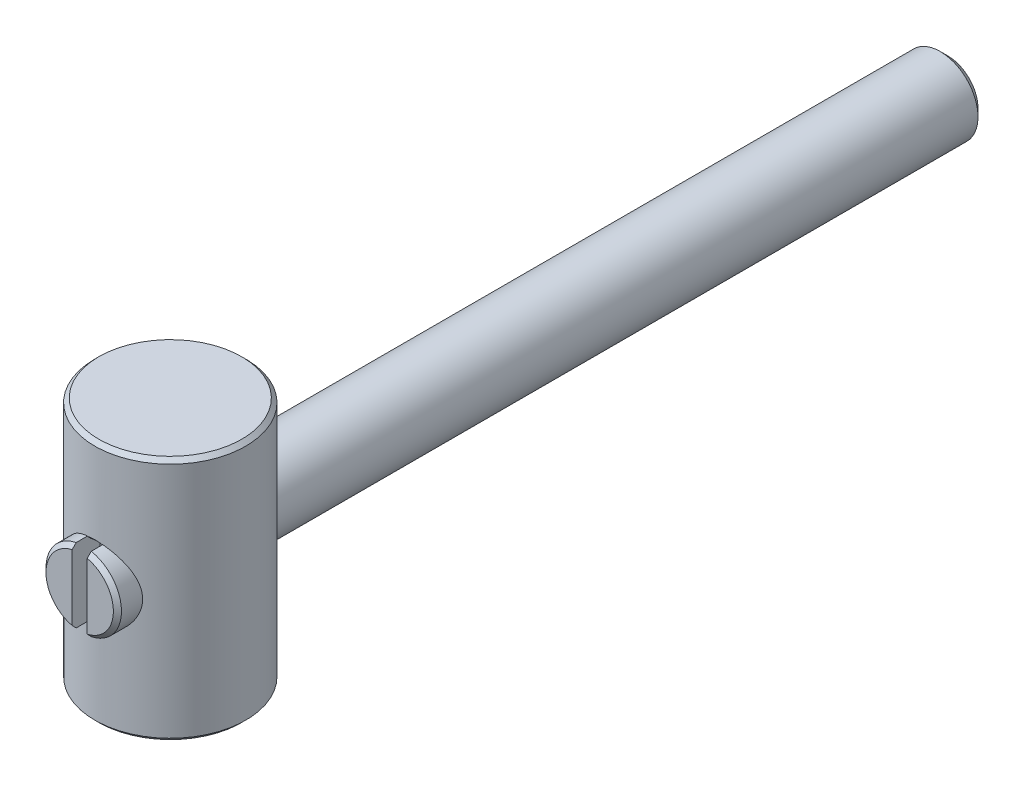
ISO-10303-21;
HEADER;
FILE_DESCRIPTION(('STEP AP214'),'2;1');
FILE_NAME('part.step','',(''),(''),'','','');
FILE_SCHEMA(('AUTOMOTIVE_DESIGN { 1 0 10303 214 1 1 1 1 }'));
ENDSEC;
DATA;
#1=APPLICATION_CONTEXT('core data for automotive mechanical design processes');
#2=APPLICATION_PROTOCOL_DEFINITION('international standard','automotive_design',2000,#1);
#3=PRODUCT_CONTEXT('',#1,'mechanical');
#4=PRODUCT('Part','Part','',(#3));
#5=PRODUCT_RELATED_PRODUCT_CATEGORY('part','',(#4));
#6=PRODUCT_DEFINITION_FORMATION('','',#4);
#7=PRODUCT_DEFINITION_CONTEXT('part definition',#1,'design');
#8=PRODUCT_DEFINITION('design','',#6,#7);
#9=PRODUCT_DEFINITION_SHAPE('','',#8);
#10=(LENGTH_UNIT() NAMED_UNIT(*) SI_UNIT(.MILLI.,.METRE.));
#11=(NAMED_UNIT(*) PLANE_ANGLE_UNIT() SI_UNIT($,.RADIAN.));
#12=(NAMED_UNIT(*) SI_UNIT($,.STERADIAN.) SOLID_ANGLE_UNIT());
#13=UNCERTAINTY_MEASURE_WITH_UNIT(LENGTH_MEASURE(1.E-05),#10,'distance_accuracy_value','');
#14=(GEOMETRIC_REPRESENTATION_CONTEXT(3) GLOBAL_UNCERTAINTY_ASSIGNED_CONTEXT((#13)) GLOBAL_UNIT_ASSIGNED_CONTEXT((#10,
#11,#12)) REPRESENTATION_CONTEXT('',''));
#15=CARTESIAN_POINT('',(0.,0.,0.));
#16=DIRECTION('',(0.,0.,1.));
#17=DIRECTION('',(1.,0.,0.));
#18=AXIS2_PLACEMENT_3D('',#15,#16,#17);
#19=CARTESIAN_POINT('',(0.,0.,4.8));
#20=DIRECTION('',(0.,0.,-1.));
#21=DIRECTION('',(-1.,0.,0.));
#22=AXIS2_PLACEMENT_3D('',#19,#20,#21);
#23=PLANE('',#22);
#24=DIRECTION('',(0.,-1.,0.));
#25=VECTOR('',#24,1.);
#26=CARTESIAN_POINT('',(-0.4,0.,4.8));
#27=LINE('',#26,#25);
#28=CARTESIAN_POINT('',(-0.4,1.74011788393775,4.8));
#29=VERTEX_POINT('',#28);
#30=CARTESIAN_POINT('',(-0.4,-1.74011788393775,4.8));
#31=VERTEX_POINT('',#30);
#32=EDGE_CURVE('E123',#29,#31,#27,.T.);
#33=ORIENTED_EDGE('',*,*,#32,.F.);
#34=CARTESIAN_POINT('',(0.,0.,4.8));
#35=DIRECTION('',(0.,0.,-1.));
#36=DIRECTION('',(-1.,0.,0.));
#37=AXIS2_PLACEMENT_3D('',#34,#35,#36);
#38=CIRCLE('',#37,1.7855);
#39=EDGE_CURVE('E122',#31,#29,#38,.T.);
#40=ORIENTED_EDGE('',*,*,#39,.F.);
#41=EDGE_LOOP('',(#33,#40));
#42=FACE_BOUND('',#41,.T.);
#43=ADVANCED_FACE('F14',(#42),#23,.F.);
#44=CARTESIAN_POINT('',(0.,0.,4.8));
#45=DIRECTION('',(0.,0.,-1.));
#46=DIRECTION('',(-1.,0.,0.));
#47=AXIS2_PLACEMENT_3D('',#44,#45,#46);
#48=CONICAL_SURFACE('',#47,1.7855,0.785398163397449);
#49=CARTESIAN_POINT('',(-0.4,4.38544390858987,2.18185170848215));
#50=CARTESIAN_POINT('',(-0.4,4.22814452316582,2.33849490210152));
#51=CARTESIAN_POINT('',(-0.4,4.07081593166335,2.49510881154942));
#52=CARTESIAN_POINT('',(-0.4,3.75604765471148,2.80824900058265));
#53=CARTESIAN_POINT('',(-0.4,3.59860796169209,2.96477527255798));
#54=CARTESIAN_POINT('',(-0.4,3.28330186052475,3.27797222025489));
#55=CARTESIAN_POINT('',(-0.4,3.12543519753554,3.43464263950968));
#56=CARTESIAN_POINT('',(-0.4,2.80949525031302,3.74775156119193));
#57=CARTESIAN_POINT('',(-0.4,2.65142198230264,3.90419007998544));
#58=CARTESIAN_POINT('',(-0.4,2.34523716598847,4.20651333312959));
#59=CARTESIAN_POINT('',(-0.4,2.19714827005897,4.35242098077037));
#60=CARTESIAN_POINT('',(-0.4,1.9745743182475,4.57086698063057));
#61=CARTESIAN_POINT('',(-0.4,1.90030121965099,4.64362119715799));
#62=CARTESIAN_POINT('',(-0.4,1.75155548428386,4.78892225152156));
#63=CARTESIAN_POINT('',(-0.4,1.67708285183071,4.86146909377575));
#64=CARTESIAN_POINT('',(-0.4,1.52792681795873,5.0061860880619));
#65=CARTESIAN_POINT('',(-0.4,1.45324372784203,5.07835656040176));
#66=CARTESIAN_POINT('',(-0.4,1.303425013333,5.22223884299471));
#67=CARTESIAN_POINT('',(-0.4,1.22828935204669,5.29395061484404));
#68=CARTESIAN_POINT('',(-0.4,1.07732483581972,5.436586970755));
#69=CARTESIAN_POINT('',(-0.4,1.00149626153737,5.50751184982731));
#70=CARTESIAN_POINT('',(-0.4,0.886762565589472,5.61281093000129));
#71=CARTESIAN_POINT('',(-0.4,0.848355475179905,5.64772694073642));
#72=CARTESIAN_POINT('',(-0.4,0.771065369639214,5.71702726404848));
#73=CARTESIAN_POINT('',(-0.4,0.732182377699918,5.75141160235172));
#74=CARTESIAN_POINT('',(-0.4,0.670990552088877,5.80440505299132));
#75=CARTESIAN_POINT('',(-0.4,0.648923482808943,5.82329300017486));
#76=CARTESIAN_POINT('',(-0.4,0.604504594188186,5.86073627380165));
#77=CARTESIAN_POINT('',(-0.4,0.582152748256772,5.87929156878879));
#78=CARTESIAN_POINT('',(-0.4,0.536811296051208,5.91617925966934));
#79=CARTESIAN_POINT('',(-0.4,0.513817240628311,5.9345062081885));
#80=CARTESIAN_POINT('',(-0.4,0.467342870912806,5.97052571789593));
#81=CARTESIAN_POINT('',(-0.4,0.443862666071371,5.98821841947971));
#82=CARTESIAN_POINT('',(-0.4,0.395899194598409,6.02295404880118));
#83=CARTESIAN_POINT('',(-0.4,0.371406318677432,6.0399838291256));
#84=CARTESIAN_POINT('',(-0.4,0.321466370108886,6.07268136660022));
#85=CARTESIAN_POINT('',(-0.4,0.296018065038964,6.08834727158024));
#86=CARTESIAN_POINT('',(-0.4,0.244218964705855,6.11732584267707));
#87=CARTESIAN_POINT('',(-0.4,0.217884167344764,6.13066640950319));
#88=CARTESIAN_POINT('',(-0.4,0.1637878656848,6.15395132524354));
#89=CARTESIAN_POINT('',(-0.4,0.136031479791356,6.16390699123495));
#90=CARTESIAN_POINT('',(-0.4,0.0811637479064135,6.17813666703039));
#91=CARTESIAN_POINT('',(-0.4,0.0541522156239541,6.18277112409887));
#92=CARTESIAN_POINT('',(-0.4,-0.000201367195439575,6.18641177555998));
#93=CARTESIAN_POINT('',(-0.4,-0.0275422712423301,6.18543380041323));
#94=CARTESIAN_POINT('',(-0.4,-0.08124913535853,6.17820280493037));
#95=CARTESIAN_POINT('',(-0.4,-0.107621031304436,6.17199093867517));
#96=CARTESIAN_POINT('',(-0.4,-0.146271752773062,6.15977299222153));
#97=CARTESIAN_POINT('',(-0.4,-0.159041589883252,6.1551986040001));
#98=CARTESIAN_POINT('',(-0.4,-0.184264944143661,6.14525020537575));
#99=CARTESIAN_POINT('',(-0.4,-0.196718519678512,6.13987634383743));
#100=CARTESIAN_POINT('',(-0.4,-0.23353200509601,6.12283069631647));
#101=CARTESIAN_POINT('',(-0.4,-0.257445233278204,6.1102004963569));
#102=CARTESIAN_POINT('',(-0.4,-0.304317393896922,6.08326318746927));
#103=CARTESIAN_POINT('',(-0.4,-0.327275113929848,6.06895403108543));
#104=CARTESIAN_POINT('',(-0.4,-0.37252645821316,6.03916204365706));
#105=CARTESIAN_POINT('',(-0.4,-0.39481743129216,6.0236752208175));
#106=CARTESIAN_POINT('',(-0.4,-0.438833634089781,5.99191398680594));
#107=CARTESIAN_POINT('',(-0.4,-0.460558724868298,5.97563938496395));
#108=CARTESIAN_POINT('',(-0.4,-0.525520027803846,5.92565754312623));
#109=CARTESIAN_POINT('',(-0.4,-0.568098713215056,5.89109840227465));
#110=CARTESIAN_POINT('',(-0.4,-0.631123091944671,5.83837882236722));
#111=CARTESIAN_POINT('',(-0.4,-0.651965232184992,5.82068135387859));
#112=CARTESIAN_POINT('',(-0.4,-0.693435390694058,5.7850382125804));
#113=CARTESIAN_POINT('',(-0.4,-0.714063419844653,5.76709255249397));
#114=CARTESIAN_POINT('',(-0.4,-0.774606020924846,5.71392260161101));
#115=CARTESIAN_POINT('',(-0.4,-0.814284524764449,5.67843014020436));
#116=CARTESIAN_POINT('',(-0.4,-0.893204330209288,5.60696168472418));
#117=CARTESIAN_POINT('',(-0.4,-0.932445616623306,5.57098567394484));
#118=CARTESIAN_POINT('',(-0.4,-1.04971807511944,5.46255349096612));
#119=CARTESIAN_POINT('',(-0.4,-1.12728939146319,5.38960072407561));
#120=CARTESIAN_POINT('',(-0.4,-1.28178514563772,5.24296666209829));
#121=CARTESIAN_POINT('',(-0.4,-1.35870936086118,5.16928513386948));
#122=CARTESIAN_POINT('',(-0.4,-1.51213277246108,5.0214909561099));
#123=CARTESIAN_POINT('',(-0.4,-1.58863199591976,4.94737833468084));
#124=CARTESIAN_POINT('',(-0.4,-1.81796193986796,4.72440140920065));
#125=CARTESIAN_POINT('',(-0.4,-1.97038982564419,4.57512336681));
#126=CARTESIAN_POINT('',(-0.4,-2.27470082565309,4.27606244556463));
#127=CARTESIAN_POINT('',(-0.4,-2.4265840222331,4.12627965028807));
#128=CARTESIAN_POINT('',(-0.4,-2.65349094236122,3.90205377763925));
#129=CARTESIAN_POINT('',(-0.4,-2.72863003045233,3.82772743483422));
#130=CARTESIAN_POINT('',(-0.4,-2.87885103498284,3.67901233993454));
#131=CARTESIAN_POINT('',(-0.4,-2.95393294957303,3.60462358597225));
#132=CARTESIAN_POINT('',(-0.4,-3.17903278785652,3.3814616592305));
#133=CARTESIAN_POINT('',(-0.4,-3.32898065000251,3.23261781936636));
#134=CARTESIAN_POINT('',(-0.4,-3.63002720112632,2.93354169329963));
#135=CARTESIAN_POINT('',(-0.4,-3.78112484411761,2.78330835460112));
#136=CARTESIAN_POINT('',(-0.4,-4.0833055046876,2.48267648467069));
#137=CARTESIAN_POINT('',(-0.4,-4.2343884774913,2.3322779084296));
#138=CARTESIAN_POINT('',(-0.4,-4.38544390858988,2.18185170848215));
#139=B_SPLINE_CURVE_WITH_KNOTS('',3,(#49,#50,#51,#52,#53,#54,#55,#56,#57,#58,#59,#60,#61,#62,
#63,#64,#65,#66,#67,#68,#69,#70,#71,#72,#73,#74,#75,#76,#77,#78,#79,#80,#81,#82,#83,#84,#85,#86,
#87,#88,#89,#90,#91,#92,#93,#94,#95,#96,#97,#98,#99,#100,#101,#102,#103,#104,#105,#106,#107,
#108,#109,#110,#111,#112,#113,#114,#115,#116,#117,#118,#119,#120,#121,#122,#123,#124,#125,#126,
#127,#128,#129,#130,#131,#132,#133,#134,#135,#136,#137,#138),.UNSPECIFIED.,.F.,.F.,(4,2,2,2,2,2,
2,2,2,2,2,2,2,2,2,2,2,2,2,2,2,2,2,2,2,2,2,2,2,2,2,2,2,2,2,2,2,2,2,2,2,2,2,2,4),(0.,
0.665974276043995,1.33199943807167,1.99923802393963,2.6664270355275,3.29010400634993,
3.60201239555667,3.91391408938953,4.22548161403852,4.53707489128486,4.84854710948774,
5.00426229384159,5.15996991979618,5.24710757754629,5.33425343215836,5.42245810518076,
5.51064313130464,5.60010728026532,5.68969108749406,5.77811232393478,5.86623495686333,
5.9479508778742,6.0294364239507,6.1102871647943,6.15096076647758,6.19162680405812,
6.27264196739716,6.35375697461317,6.43516036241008,6.5165835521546,6.68104442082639,
6.76307124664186,6.84509388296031,7.00479619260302,7.16450403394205,7.48395372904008,
7.80350915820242,8.12304398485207,8.76309054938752,9.40303588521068,9.72010458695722,
10.037183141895,10.6710202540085,11.3102423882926,11.9497829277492),.UNSPECIFIED.);
#140=CARTESIAN_POINT('',(-0.4,1.95959179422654,4.5855));
#141=VERTEX_POINT('',#140);
#142=EDGE_CURVE('E104',#141,#29,#139,.T.);
#143=ORIENTED_EDGE('',*,*,#142,.F.);
#144=CARTESIAN_POINT('',(0.,0.,4.5855));
#145=DIRECTION('',(0.,0.,-1.));
#146=DIRECTION('',(-1.,0.,0.));
#147=AXIS2_PLACEMENT_3D('',#144,#145,#146);
#148=CIRCLE('',#147,2.);
#149=CARTESIAN_POINT('',(-0.4,-1.95959179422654,4.5855));
#150=VERTEX_POINT('',#149);
#151=EDGE_CURVE('E120',#150,#141,#148,.T.);
#152=ORIENTED_EDGE('',*,*,#151,.F.);
#153=EDGE_CURVE('E126',#31,#150,#139,.T.);
#154=ORIENTED_EDGE('',*,*,#153,.F.);
#155=ORIENTED_EDGE('',*,*,#39,.T.);
#156=EDGE_LOOP('',(#143,#152,#154,#155));
#157=FACE_BOUND('',#156,.T.);
#158=ADVANCED_FACE('F118',(#157),#48,.T.);
#159=CARTESIAN_POINT('',(0.4,0.,34.8));
#160=DIRECTION('',(-1.,0.,0.));
#161=DIRECTION('',(0.,-1.,0.));
#162=AXIS2_PLACEMENT_3D('',#159,#160,#161);
#163=CYLINDRICAL_SURFACE('',#162,31.5);
#164=CARTESIAN_POINT('',(0.4,-1.76576053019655,3.34952957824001));
#165=CARTESIAN_POINT('',(0.349977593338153,-1.77709824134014,3.35016706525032));
#166=CARTESIAN_POINT('',(0.299469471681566,-1.78629930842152,3.35068890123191));
#167=CARTESIAN_POINT('',(0.197847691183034,-1.80038671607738,3.35149171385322));
#168=CARTESIAN_POINT('',(0.146733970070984,-1.8052726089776,3.35177266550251));
#169=CARTESIAN_POINT('',(0.0452193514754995,-1.81063609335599,3.35208115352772));
#170=CARTESIAN_POINT('',(-0.00517737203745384,-1.81119308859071,3.35211325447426));
#171=CARTESIAN_POINT('',(-0.105833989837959,-1.80810483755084,3.3519355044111));
#172=CARTESIAN_POINT('',(-0.156093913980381,-1.8044605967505,3.35172571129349));
#173=CARTESIAN_POINT('',(-0.238696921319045,-1.79499603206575,3.3511843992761));
#174=CARTESIAN_POINT('',(-0.271182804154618,-1.7903758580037,3.35092073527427));
#175=CARTESIAN_POINT('',(-0.335843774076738,-1.77938039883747,3.35029676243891));
#176=CARTESIAN_POINT('',(-0.368018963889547,-1.77300571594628,3.34993648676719));
#177=CARTESIAN_POINT('',(-0.4,-1.76576053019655,3.34952957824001));
#178=B_SPLINE_CURVE_WITH_KNOTS('',3,(#164,#165,#166,#167,#168,#169,#170,#171,#172,#173,#174,
#175,#176,#177),.UNSPECIFIED.,.F.,.F.,(4,2,2,2,2,2,4),(0.,0.153839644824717,0.307695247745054,
0.458721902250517,0.609712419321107,0.708108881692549,0.806471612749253),.UNSPECIFIED.);
#179=CARTESIAN_POINT('',(0.4,-1.76576053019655,3.34952957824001));
#180=VERTEX_POINT('',#179);
#181=CARTESIAN_POINT('',(-0.4,-1.76576053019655,3.34952957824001));
#182=VERTEX_POINT('',#181);
#183=EDGE_CURVE('E250',#180,#182,#178,.T.);
#184=ORIENTED_EDGE('',*,*,#183,.F.);
#185=CARTESIAN_POINT('',(0.4,0.,34.8));
#186=DIRECTION('',(1.,0.,0.));
#187=DIRECTION('',(0.,1.,0.));
#188=AXIS2_PLACEMENT_3D('',#185,#186,#187);
#189=CIRCLE('',#188,31.5);
#190=CARTESIAN_POINT('',(0.4,1.76576053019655,3.34952957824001));
#191=VERTEX_POINT('',#190);
#192=EDGE_CURVE('E124',#180,#191,#189,.T.);
#193=ORIENTED_EDGE('',*,*,#192,.T.);
#194=CARTESIAN_POINT('',(-0.4,1.76576053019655,3.34952957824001));
#195=CARTESIAN_POINT('',(-0.349977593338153,1.77709824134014,3.35016706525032));
#196=CARTESIAN_POINT('',(-0.299469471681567,1.78629930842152,3.35068890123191));
#197=CARTESIAN_POINT('',(-0.197847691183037,1.80038671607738,3.35149171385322));
#198=CARTESIAN_POINT('',(-0.146733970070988,1.8052726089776,3.35177266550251));
#199=CARTESIAN_POINT('',(-0.0452193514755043,1.81063609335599,3.35208115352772));
#200=CARTESIAN_POINT('',(0.00517737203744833,1.81119308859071,3.35211325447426));
#201=CARTESIAN_POINT('',(0.105833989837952,1.80810483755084,3.3519355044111));
#202=CARTESIAN_POINT('',(0.156093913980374,1.8044605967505,3.35172571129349));
#203=CARTESIAN_POINT('',(0.238696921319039,1.79499603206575,3.3511843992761));
#204=CARTESIAN_POINT('',(0.271182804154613,1.7903758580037,3.35092073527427));
#205=CARTESIAN_POINT('',(0.335843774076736,1.77938039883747,3.35029676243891));
#206=CARTESIAN_POINT('',(0.368018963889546,1.77300571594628,3.34993648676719));
#207=CARTESIAN_POINT('',(0.4,1.76576053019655,3.34952957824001));
#208=B_SPLINE_CURVE_WITH_KNOTS('',3,(#194,#195,#196,#197,#198,#199,#200,#201,#202,#203,#204,
#205,#206,#207),.UNSPECIFIED.,.F.,.F.,(4,2,2,2,2,2,4),(0.,0.153839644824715,0.307695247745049,
0.45872190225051,0.609712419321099,0.708108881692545,0.806471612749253),.UNSPECIFIED.);
#209=CARTESIAN_POINT('',(-0.4,1.76576053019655,3.34952957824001));
#210=VERTEX_POINT('',#209);
#211=EDGE_CURVE('E248',#210,#191,#208,.T.);
#212=ORIENTED_EDGE('',*,*,#211,.F.);
#213=CARTESIAN_POINT('',(-0.4,0.,34.8));
#214=DIRECTION('',(1.,0.,0.));
#215=DIRECTION('',(0.,1.,0.));
#216=AXIS2_PLACEMENT_3D('',#213,#214,#215);
#217=CIRCLE('',#216,31.5);
#218=EDGE_CURVE('E238',#182,#210,#217,.T.);
#219=ORIENTED_EDGE('',*,*,#218,.F.);
#220=EDGE_LOOP('',(#184,#193,#212,#219));
#221=FACE_BOUND('',#220,.T.);
#222=ADVANCED_FACE('F245',(#221),#163,.F.);
#223=CARTESIAN_POINT('',(0.,0.,-4.7));
#224=DIRECTION('',(0.,0.,-1.));
#225=DIRECTION('',(-1.,0.,0.));
#226=AXIS2_PLACEMENT_3D('',#223,#224,#225);
#227=CYLINDRICAL_SURFACE('',#226,2.);
#228=CARTESIAN_POINT('',(-2.,0.,3.46410161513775));
#229=CARTESIAN_POINT('',(-1.99999158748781,0.104213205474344,3.46411185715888));
#230=CARTESIAN_POINT('',(-1.99179963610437,0.208562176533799,3.46887633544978));
#231=CARTESIAN_POINT('',(-1.95944672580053,0.4140551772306,3.48724701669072));
#232=CARTESIAN_POINT('',(-1.93525221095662,0.51519200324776,3.50087179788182));
#233=CARTESIAN_POINT('',(-1.8721998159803,0.710903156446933,3.53498701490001));
#234=CARTESIAN_POINT('',(-1.83341988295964,0.805509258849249,3.55544089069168));
#235=CARTESIAN_POINT('',(-1.74253507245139,0.986848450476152,3.60085327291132));
#236=CARTESIAN_POINT('',(-1.69042947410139,1.07358111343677,3.62581202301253));
#237=CARTESIAN_POINT('',(-1.56933307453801,1.24461144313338,3.67993738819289));
#238=CARTESIAN_POINT('',(-1.49930407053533,1.32811826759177,3.70928127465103));
#239=CARTESIAN_POINT('',(-1.34650761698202,1.4828167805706,3.76743965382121));
#240=CARTESIAN_POINT('',(-1.26373385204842,1.55400232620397,3.79625387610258));
#241=CARTESIAN_POINT('',(-1.08097912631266,1.6867343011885,3.85242953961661));
#242=CARTESIAN_POINT('',(-0.980214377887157,1.74730753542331,3.87956212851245));
#243=CARTESIAN_POINT('',(-0.768314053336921,1.85028170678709,3.92701512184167));
#244=CARTESIAN_POINT('',(-0.65718507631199,1.8926941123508,3.94733982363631));
#245=CARTESIAN_POINT('',(-0.436089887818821,1.95500932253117,3.97760922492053));
#246=CARTESIAN_POINT('',(-0.326603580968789,1.9762990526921,3.9881896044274));
#247=CARTESIAN_POINT('',(-0.105141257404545,2.00033223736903,4.00015167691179));
#248=CARTESIAN_POINT('',(0.00683321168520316,2.00308691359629,4.00153893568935));
#249=CARTESIAN_POINT('',(0.219665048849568,1.99050665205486,3.99525963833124));
#250=CARTESIAN_POINT('',(0.320642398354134,1.97672396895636,3.98836991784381));
#251=CARTESIAN_POINT('',(0.518627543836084,1.93423831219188,3.96748490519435));
#252=CARTESIAN_POINT('',(0.615635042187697,1.90553422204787,3.95348908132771));
#253=CARTESIAN_POINT('',(0.804618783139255,1.83383486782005,3.91943166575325));
#254=CARTESIAN_POINT('',(0.896506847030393,1.79064737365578,3.89928883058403));
#255=CARTESIAN_POINT('',(1.07195360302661,1.6914731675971,3.8547529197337));
#256=CARTESIAN_POINT('',(1.15550929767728,1.63548187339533,3.83035832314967));
#257=CARTESIAN_POINT('',(1.3203473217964,1.50620929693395,3.7768878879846));
#258=CARTESIAN_POINT('',(1.40066815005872,1.43179394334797,3.74758751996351));
#259=CARTESIAN_POINT('',(1.54820874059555,1.27082055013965,3.68908681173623));
#260=CARTESIAN_POINT('',(1.61541842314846,1.18425325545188,3.65988656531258));
#261=CARTESIAN_POINT('',(1.73901066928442,0.994703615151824,3.60288312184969));
#262=CARTESIAN_POINT('',(1.7944346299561,0.891027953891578,3.57528639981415));
#263=CARTESIAN_POINT('',(1.88663822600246,0.674124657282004,3.52750900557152));
#264=CARTESIAN_POINT('',(1.92343731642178,0.560907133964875,3.50732060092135));
#265=CARTESIAN_POINT('',(1.97436042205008,0.337570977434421,3.47889271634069));
#266=CARTESIAN_POINT('',(1.99005024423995,0.227917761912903,3.46983311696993));
#267=CARTESIAN_POINT('',(2.00303389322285,0.00719731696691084,3.46235838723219));
#268=CARTESIAN_POINT('',(2.00034071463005,-0.103868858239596,3.46393573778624));
#269=CARTESIAN_POINT('',(1.97807208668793,-0.311307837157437,3.4766867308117));
#270=CARTESIAN_POINT('',(1.96037563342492,-0.407958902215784,3.48679175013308));
#271=CARTESIAN_POINT('',(1.91139256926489,-0.596735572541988,3.51388043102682));
#272=CARTESIAN_POINT('',(1.88010155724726,-0.688859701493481,3.53086632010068));
#273=CARTESIAN_POINT('',(1.80329517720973,-0.870822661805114,3.57072444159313));
#274=CARTESIAN_POINT('',(1.75718812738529,-0.96035803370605,3.59383286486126));
#275=CARTESIAN_POINT('',(1.65257412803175,-1.13093854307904,3.643122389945));
#276=CARTESIAN_POINT('',(1.59406080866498,-1.21197928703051,3.66930506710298));
#277=CARTESIAN_POINT('',(1.45767433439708,-1.37395753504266,3.72575996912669));
#278=CARTESIAN_POINT('',(1.37829054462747,-1.45359430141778,3.75613166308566));
#279=CARTESIAN_POINT('',(1.20680899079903,-1.59882447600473,3.81468469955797));
#280=CARTESIAN_POINT('',(1.1147069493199,-1.66441314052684,3.84286530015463));
#281=CARTESIAN_POINT('',(0.917070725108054,-1.78114745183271,3.89482723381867));
#282=CARTESIAN_POINT('',(0.81124619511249,-1.83186623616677,3.91847283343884));
#283=CARTESIAN_POINT('',(0.591044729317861,-1.91427580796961,3.95766709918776));
#284=CARTESIAN_POINT('',(0.476675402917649,-1.9459833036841,3.97322287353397));
#285=CARTESIAN_POINT('',(0.25395936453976,-1.98673712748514,3.99335016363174));
#286=CARTESIAN_POINT('',(0.146022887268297,-1.99759574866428,3.9987985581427));
#287=CARTESIAN_POINT('',(-0.0702519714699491,-2.00168653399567,4.00084260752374));
#288=CARTESIAN_POINT('',(-0.178590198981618,-1.99492486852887,3.99744136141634));
#289=CARTESIAN_POINT('',(-0.385075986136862,-1.96516717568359,3.98267937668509));
#290=CARTESIAN_POINT('',(-0.483424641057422,-1.94327026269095,3.97185789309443));
#291=CARTESIAN_POINT('',(-0.674891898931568,-1.88534604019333,3.94384187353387));
#292=CARTESIAN_POINT('',(-0.768009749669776,-1.84931670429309,3.92664642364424));
#293=CARTESIAN_POINT('',(-0.950846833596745,-1.7625457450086,3.8865186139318));
#294=CARTESIAN_POINT('',(-1.0402503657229,-1.71124078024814,3.86337234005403));
#295=CARTESIAN_POINT('',(-1.20954920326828,-1.59608471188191,3.81376266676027));
#296=CARTESIAN_POINT('',(-1.28944011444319,-1.53222784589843,3.78729774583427));
#297=CARTESIAN_POINT('',(-1.44582833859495,-1.38640336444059,3.73057218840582));
#298=CARTESIAN_POINT('',(-1.52119665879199,-1.30326581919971,3.70019591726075));
#299=CARTESIAN_POINT('',(-1.65732528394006,-1.12510777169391,3.64126158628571));
#300=CARTESIAN_POINT('',(-1.71807266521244,-1.03007686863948,3.61270515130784));
#301=CARTESIAN_POINT('',(-1.82486714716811,-0.826691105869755,3.55999186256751));
#302=CARTESIAN_POINT('',(-1.87038902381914,-0.718010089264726,3.53600256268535));
#303=CARTESIAN_POINT('',(-1.92395929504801,-0.549421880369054,3.5069621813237));
#304=CARTESIAN_POINT('',(-1.93935666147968,-0.492352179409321,3.49844389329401));
#305=CARTESIAN_POINT('',(-1.96508069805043,-0.376767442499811,3.48406059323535));
#306=CARTESIAN_POINT('',(-1.97541091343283,-0.318253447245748,3.4781937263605));
#307=CARTESIAN_POINT('',(-1.98872932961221,-0.21639921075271,3.47059023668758));
#308=CARTESIAN_POINT('',(-1.99295091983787,-0.173266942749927,3.46816389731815));
#309=CARTESIAN_POINT('',(-1.99858810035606,-0.0867643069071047,3.46491740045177));
#310=CARTESIAN_POINT('',(-2.00000350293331,-0.0433939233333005,3.46409735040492));
#311=CARTESIAN_POINT('',(-2.,0.,3.46410161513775));
#312=B_SPLINE_CURVE_WITH_KNOTS('',3,(#228,#229,#230,#231,#232,#233,#234,#235,#236,#237,#238,
#239,#240,#241,#242,#243,#244,#245,#246,#247,#248,#249,#250,#251,#252,#253,#254,#255,#256,#257,
#258,#259,#260,#261,#262,#263,#264,#265,#266,#267,#268,#269,#270,#271,#272,#273,#274,#275,#276,
#277,#278,#279,#280,#281,#282,#283,#284,#285,#286,#287,#288,#289,#290,#291,#292,#293,#294,#295,
#296,#297,#298,#299,#300,#301,#302,#303,#304,#305,#306,#307,#308,#309,#310,#311),.UNSPECIFIED.,
.T.,.F.,(4,2,2,2,2,2,2,2,2,2,2,2,2,2,2,2,2,2,2,2,2,2,2,2,2,2,2,2,2,2,2,2,2,2,2,2,2,2,2,2,2,4),
(0.,0.312464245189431,0.625585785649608,0.937057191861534,1.24854545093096,1.58572462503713,
1.92307142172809,2.28315784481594,2.64301653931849,2.97726969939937,3.31132047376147,
3.61632194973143,3.92134625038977,4.2305906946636,4.5399459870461,4.87854382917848,
5.21740096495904,5.57777683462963,5.93777548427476,6.2692458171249,6.60048186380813,
6.89548366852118,7.19058104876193,7.49934592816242,7.80826972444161,8.15613487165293,
8.50411729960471,8.86128362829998,9.2181355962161,9.5422454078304,9.8662417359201,
10.1688884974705,10.4715786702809,10.7872150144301,11.102996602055,11.450204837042,
11.7977188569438,12.1562149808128,12.3351395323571,12.5139387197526,12.6440387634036,
12.7741475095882),.UNSPECIFIED.);
#313=CARTESIAN_POINT('',(-0.4,-1.95959179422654,3.97994974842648));
#314=VERTEX_POINT('',#313);
#315=CARTESIAN_POINT('',(-0.4,1.95959179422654,3.97994974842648));
#316=VERTEX_POINT('',#315);
#317=EDGE_CURVE('E319',#314,#316,#312,.T.);
#318=ORIENTED_EDGE('',*,*,#317,.F.);
#319=DIRECTION('',(0.,0.,-1.));
#320=VECTOR('',#319,1.);
#321=CARTESIAN_POINT('',(-0.4,-1.95959179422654,-4.7));
#322=LINE('',#321,#320);
#323=EDGE_CURVE('E129',#150,#314,#322,.T.);
#324=ORIENTED_EDGE('',*,*,#323,.F.);
#325=ORIENTED_EDGE('',*,*,#151,.T.);
#326=DIRECTION('',(0.,0.,-1.));
#327=VECTOR('',#326,1.);
#328=CARTESIAN_POINT('',(-0.4,1.95959179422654,-4.7));
#329=LINE('',#328,#327);
#330=EDGE_CURVE('E100',#316,#141,#329,.F.);
#331=ORIENTED_EDGE('',*,*,#330,.F.);
#332=EDGE_LOOP('',(#318,#324,#325,#331));
#333=FACE_BOUND('',#332,.T.);
#334=ADVANCED_FACE('F128',(#333),#227,.T.);
#335=CARTESIAN_POINT('',(-0.4,0.,34.8));
#336=DIRECTION('',(1.,0.,0.));
#337=DIRECTION('',(0.,1.,0.));
#338=AXIS2_PLACEMENT_3D('',#335,#336,#337);
#339=PLANE('',#338);
#340=ORIENTED_EDGE('',*,*,#323,.T.);
#341=DIRECTION('',(0.,1.,0.));
#342=VECTOR('',#341,1.);
#343=CARTESIAN_POINT('',(-0.4,6.5,3.97994974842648));
#344=LINE('',#343,#342);
#345=CARTESIAN_POINT('',(-0.4,-1.93912377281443,3.97994974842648));
#346=VERTEX_POINT('',#345);
#347=EDGE_CURVE('E257',#314,#346,#344,.T.);
#348=ORIENTED_EDGE('',*,*,#347,.T.);
#349=CARTESIAN_POINT('',(-0.4,-0.624920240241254,2.74197392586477));
#350=CARTESIAN_POINT('',(-0.4,-0.652653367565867,2.76534479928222));
#351=CARTESIAN_POINT('',(-0.4,-0.680175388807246,2.7889624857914));
#352=CARTESIAN_POINT('',(-0.4,-0.734883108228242,2.83658066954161));
#353=CARTESIAN_POINT('',(-0.4,-0.762068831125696,2.86058113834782));
#354=CARTESIAN_POINT('',(-0.4,-0.843247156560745,2.93298747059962));
#355=CARTESIAN_POINT('',(-0.4,-0.896870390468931,2.98180637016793));
#356=CARTESIAN_POINT('',(-0.4,-1.00349672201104,3.0800847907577));
#357=CARTESIAN_POINT('',(-0.4,-1.05649998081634,3.12954413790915));
#358=CARTESIAN_POINT('',(-0.4,-1.16210748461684,3.22889159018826));
#359=CARTESIAN_POINT('',(-0.4,-1.21471171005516,3.2787797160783));
#360=CARTESIAN_POINT('',(-0.4,-1.34837868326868,3.40624444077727));
#361=CARTESIAN_POINT('',(-0.4,-1.42924950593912,3.48402202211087));
#362=CARTESIAN_POINT('',(-0.4,-1.59060014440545,3.63999652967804));
#363=CARTESIAN_POINT('',(-0.4,-1.67107992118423,3.71819349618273));
#364=CARTESIAN_POINT('',(-0.4,-1.84349823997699,3.88628324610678));
#365=CARTESIAN_POINT('',(-0.4,-1.93539571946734,3.97621812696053));
#366=CARTESIAN_POINT('',(-0.4,-2.11896570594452,4.15631699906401));
#367=CARTESIAN_POINT('',(-0.4,-2.21063821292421,4.24648099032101));
#368=CARTESIAN_POINT('',(-0.4,-2.39380444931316,4.42694304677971));
#369=CARTESIAN_POINT('',(-0.4,-2.48529821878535,4.51724107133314));
#370=CARTESIAN_POINT('',(-0.4,-2.66817104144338,4.69795263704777));
#371=CARTESIAN_POINT('',(-0.4,-2.75955009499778,4.78836617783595));
#372=CARTESIAN_POINT('',(-0.4,-2.85089224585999,4.87881687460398));
#373=B_SPLINE_CURVE_WITH_KNOTS('',3,(#349,#350,#351,#352,#353,#354,#355,#356,#357,#358,#359,
#360,#361,#362,#363,#364,#365,#366,#367,#368,#369,#370,#371,#372),.UNSPECIFIED.,.F.,.F.,(4,2,2,
2,2,2,2,2,2,2,2,4),(0.,0.108797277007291,0.217586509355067,0.435127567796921,0.65261075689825,
0.870104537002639,1.20670989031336,1.54334816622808,1.92909464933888,2.31484114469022,
2.70048799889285,3.08613361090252),.UNSPECIFIED.);
#374=CARTESIAN_POINT('',(-0.4,-1.76576053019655,3.8105));
#375=VERTEX_POINT('',#374);
#376=EDGE_CURVE('E189',#375,#346,#373,.T.);
#377=ORIENTED_EDGE('',*,*,#376,.F.);
#378=DIRECTION('',(0.,0.,-1.));
#379=VECTOR('',#378,1.);
#380=CARTESIAN_POINT('',(-0.4,-1.76576053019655,-4.));
#381=LINE('',#380,#379);
#382=EDGE_CURVE('E320',#182,#375,#381,.F.);
#383=ORIENTED_EDGE('',*,*,#382,.F.);
#384=ORIENTED_EDGE('',*,*,#218,.T.);
#385=DIRECTION('',(0.,0.,-1.));
#386=VECTOR('',#385,1.);
#387=CARTESIAN_POINT('',(-0.4,1.76576053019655,-4.));
#388=LINE('',#387,#386);
#389=CARTESIAN_POINT('',(-0.4,1.76576053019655,3.8105));
#390=VERTEX_POINT('',#389);
#391=EDGE_CURVE('E146',#390,#210,#388,.T.);
#392=ORIENTED_EDGE('',*,*,#391,.F.);
#393=CARTESIAN_POINT('',(-0.4,2.91587738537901,4.94318550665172));
#394=CARTESIAN_POINT('',(-0.4,2.82350327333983,4.85167351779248));
#395=CARTESIAN_POINT('',(-0.4,2.73109369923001,4.76019722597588));
#396=CARTESIAN_POINT('',(-0.4,2.54616753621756,4.57735709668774));
#397=CARTESIAN_POINT('',(-0.4,2.45365094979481,4.48599325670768));
#398=CARTESIAN_POINT('',(-0.4,2.26848279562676,4.30342707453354));
#399=CARTESIAN_POINT('',(-0.4,2.17583124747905,4.21222471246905));
#400=CARTESIAN_POINT('',(-0.4,1.99031330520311,4.03003417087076));
#401=CARTESIAN_POINT('',(-0.4,1.897446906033,3.93904599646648));
#402=CARTESIAN_POINT('',(-0.4,1.71137075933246,3.75737997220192));
#403=CARTESIAN_POINT('',(-0.4,1.61816094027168,3.66670219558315));
#404=CARTESIAN_POINT('',(-0.4,1.43123102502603,3.48588267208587));
#405=CARTESIAN_POINT('',(-0.4,1.33751095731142,3.39574089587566));
#406=CARTESIAN_POINT('',(-0.4,1.19622398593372,3.26124884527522));
#407=CARTESIAN_POINT('',(-0.4,1.14900519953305,3.2165333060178));
#408=CARTESIAN_POINT('',(-0.4,1.05423847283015,3.12745532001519));
#409=CARTESIAN_POINT('',(-0.4,1.00669054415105,3.08309286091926));
#410=CARTESIAN_POINT('',(-0.4,0.911107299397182,2.99487455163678));
#411=CARTESIAN_POINT('',(-0.4,0.863071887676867,2.95101880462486));
#412=CARTESIAN_POINT('',(-0.4,0.790465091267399,2.8858452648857));
#413=CARTESIAN_POINT('',(-0.4,0.766169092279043,2.86422117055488));
#414=CARTESIAN_POINT('',(-0.4,0.717337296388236,2.82124351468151));
#415=CARTESIAN_POINT('',(-0.4,0.69280148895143,2.79988996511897));
#416=CARTESIAN_POINT('',(-0.4,0.668118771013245,2.77870578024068));
#417=B_SPLINE_CURVE_WITH_KNOTS('',3,(#393,#394,#395,#396,#397,#398,#399,#400,#401,#402,#403,
#404,#405,#406,#407,#408,#409,#410,#411,#412,#413,#414,#415,#416),.UNSPECIFIED.,.F.,.F.,(4,2,2,
2,2,2,2,2,2,2,2,4),(0.,0.390085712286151,0.780162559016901,1.17018750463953,1.56022169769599,
1.95034232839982,2.34044141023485,2.53553457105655,2.73062087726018,2.92574622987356,
3.02332045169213,3.12089897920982),.UNSPECIFIED.);
#418=CARTESIAN_POINT('',(-0.4,1.93912377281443,3.97994974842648));
#419=VERTEX_POINT('',#418);
#420=EDGE_CURVE('E148',#419,#390,#417,.T.);
#421=ORIENTED_EDGE('',*,*,#420,.F.);
#422=EDGE_CURVE('E107',#419,#316,#344,.T.);
#423=ORIENTED_EDGE('',*,*,#422,.T.);
#424=ORIENTED_EDGE('',*,*,#330,.T.);
#425=ORIENTED_EDGE('',*,*,#142,.T.);
#426=ORIENTED_EDGE('',*,*,#32,.T.);
#427=ORIENTED_EDGE('',*,*,#153,.T.);
#428=EDGE_LOOP('',(#340,#348,#377,#383,#384,#392,#421,#423,#424,#425,#426,#427));
#429=FACE_BOUND('',#428,.T.);
#430=ADVANCED_FACE('F103',(#429),#339,.T.);
#431=CARTESIAN_POINT('',(0.4,1.74011788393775,4.8));
#432=VERTEX_POINT('',#431);
#433=CARTESIAN_POINT('',(0.4,-1.74011788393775,4.8));
#434=VERTEX_POINT('',#433);
#435=EDGE_CURVE('E113',#432,#434,#38,.T.);
#436=ORIENTED_EDGE('',*,*,#435,.F.);
#437=DIRECTION('',(0.,-1.,0.));
#438=VECTOR('',#437,1.);
#439=CARTESIAN_POINT('',(0.4,0.,4.8));
#440=LINE('',#439,#438);
#441=EDGE_CURVE('E135',#432,#434,#440,.T.);
#442=ORIENTED_EDGE('',*,*,#441,.T.);
#443=EDGE_LOOP('',(#436,#442));
#444=FACE_BOUND('',#443,.T.);
#445=ADVANCED_FACE('F229',(#444),#23,.F.);
#446=CARTESIAN_POINT('',(0.4,1.95959179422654,4.5855));
#447=VERTEX_POINT('',#446);
#448=CARTESIAN_POINT('',(0.4,-1.95959179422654,4.5855));
#449=VERTEX_POINT('',#448);
#450=EDGE_CURVE('E130',#447,#449,#148,.T.);
#451=ORIENTED_EDGE('',*,*,#450,.F.);
#452=CARTESIAN_POINT('',(0.4,4.38544390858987,2.18185170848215));
#453=CARTESIAN_POINT('',(0.4,4.22814452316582,2.33849490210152));
#454=CARTESIAN_POINT('',(0.4,4.07081593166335,2.49510881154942));
#455=CARTESIAN_POINT('',(0.4,3.75604765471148,2.80824900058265));
#456=CARTESIAN_POINT('',(0.4,3.59860796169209,2.96477527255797));
#457=CARTESIAN_POINT('',(0.4,3.28330186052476,3.27797222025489));
#458=CARTESIAN_POINT('',(0.4,3.12543519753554,3.43464263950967));
#459=CARTESIAN_POINT('',(0.4,2.80949525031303,3.74775156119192));
#460=CARTESIAN_POINT('',(0.4,2.65142198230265,3.90419007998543));
#461=CARTESIAN_POINT('',(0.4,2.34523716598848,4.20651333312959));
#462=CARTESIAN_POINT('',(0.4,2.19714827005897,4.35242098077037));
#463=CARTESIAN_POINT('',(0.4,1.97457431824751,4.57086698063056));
#464=CARTESIAN_POINT('',(0.4,1.90030121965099,4.64362119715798));
#465=CARTESIAN_POINT('',(0.4,1.75155548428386,4.78892225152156));
#466=CARTESIAN_POINT('',(0.4,1.67708285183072,4.86146909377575));
#467=CARTESIAN_POINT('',(0.4,1.52792681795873,5.00618608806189));
#468=CARTESIAN_POINT('',(0.4,1.45324372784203,5.07835656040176));
#469=CARTESIAN_POINT('',(0.4,1.303425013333,5.22223884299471));
#470=CARTESIAN_POINT('',(0.4,1.22828935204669,5.29395061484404));
#471=CARTESIAN_POINT('',(0.4,1.07732483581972,5.43658697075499));
#472=CARTESIAN_POINT('',(0.4,1.00149626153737,5.50751184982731));
#473=CARTESIAN_POINT('',(0.4,0.886762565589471,5.61281093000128));
#474=CARTESIAN_POINT('',(0.4,0.848355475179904,5.64772694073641));
#475=CARTESIAN_POINT('',(0.4,0.771065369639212,5.71702726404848));
#476=CARTESIAN_POINT('',(0.4,0.732182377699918,5.75141160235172));
#477=CARTESIAN_POINT('',(0.4,0.670990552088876,5.80440505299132));
#478=CARTESIAN_POINT('',(0.4,0.648923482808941,5.82329300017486));
#479=CARTESIAN_POINT('',(0.4,0.604504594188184,5.86073627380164));
#480=CARTESIAN_POINT('',(0.4,0.582152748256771,5.87929156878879));
#481=CARTESIAN_POINT('',(0.4,0.536811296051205,5.91617925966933));
#482=CARTESIAN_POINT('',(0.4,0.513817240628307,5.9345062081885));
#483=CARTESIAN_POINT('',(0.4,0.467342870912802,5.97052571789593));
#484=CARTESIAN_POINT('',(0.4,0.44386266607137,5.98821841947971));
#485=CARTESIAN_POINT('',(0.4,0.395899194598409,6.02295404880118));
#486=CARTESIAN_POINT('',(0.4,0.371406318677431,6.03998382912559));
#487=CARTESIAN_POINT('',(0.4,0.321466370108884,6.07268136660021));
#488=CARTESIAN_POINT('',(0.4,0.296018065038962,6.08834727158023));
#489=CARTESIAN_POINT('',(0.4,0.244218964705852,6.11732584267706));
#490=CARTESIAN_POINT('',(0.4,0.217884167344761,6.13066640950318));
#491=CARTESIAN_POINT('',(0.4,0.163787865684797,6.15395132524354));
#492=CARTESIAN_POINT('',(0.4,0.136031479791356,6.16390699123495));
#493=CARTESIAN_POINT('',(0.4,0.0811637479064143,6.17813666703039));
#494=CARTESIAN_POINT('',(0.4,0.0541522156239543,6.18277112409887));
#495=CARTESIAN_POINT('',(0.4,-0.000201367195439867,6.18641177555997));
#496=CARTESIAN_POINT('',(0.4,-0.0275422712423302,6.18543380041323));
#497=CARTESIAN_POINT('',(0.4,-0.0812491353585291,6.17820280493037));
#498=CARTESIAN_POINT('',(0.4,-0.107621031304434,6.17199093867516));
#499=CARTESIAN_POINT('',(0.4,-0.14627175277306,6.15977299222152));
#500=CARTESIAN_POINT('',(0.4,-0.15904158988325,6.15519860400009));
#501=CARTESIAN_POINT('',(0.4,-0.184264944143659,6.14525020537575));
#502=CARTESIAN_POINT('',(0.4,-0.196718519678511,6.13987634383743));
#503=CARTESIAN_POINT('',(0.4,-0.233532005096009,6.12283069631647));
#504=CARTESIAN_POINT('',(0.4,-0.257445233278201,6.1102004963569));
#505=CARTESIAN_POINT('',(0.4,-0.304317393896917,6.08326318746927));
#506=CARTESIAN_POINT('',(0.4,-0.327275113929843,6.06895403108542));
#507=CARTESIAN_POINT('',(0.4,-0.372526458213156,6.03916204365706));
#508=CARTESIAN_POINT('',(0.4,-0.394817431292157,6.0236752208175));
#509=CARTESIAN_POINT('',(0.4,-0.438833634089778,5.99191398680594));
#510=CARTESIAN_POINT('',(0.4,-0.460558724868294,5.97563938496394));
#511=CARTESIAN_POINT('',(0.4,-0.525520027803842,5.92565754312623));
#512=CARTESIAN_POINT('',(0.4,-0.568098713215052,5.89109840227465));
#513=CARTESIAN_POINT('',(0.4,-0.631123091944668,5.83837882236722));
#514=CARTESIAN_POINT('',(0.4,-0.651965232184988,5.82068135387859));
#515=CARTESIAN_POINT('',(0.4,-0.693435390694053,5.7850382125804));
#516=CARTESIAN_POINT('',(0.4,-0.714063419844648,5.76709255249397));
#517=CARTESIAN_POINT('',(0.4,-0.77460602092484,5.71392260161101));
#518=CARTESIAN_POINT('',(0.4,-0.814284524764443,5.67843014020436));
#519=CARTESIAN_POINT('',(0.4,-0.89320433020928,5.60696168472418));
#520=CARTESIAN_POINT('',(0.4,-0.932445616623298,5.57098567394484));
#521=CARTESIAN_POINT('',(0.4,-1.04971807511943,5.46255349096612));
#522=CARTESIAN_POINT('',(0.4,-1.12728939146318,5.38960072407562));
#523=CARTESIAN_POINT('',(0.4,-1.2817851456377,5.2429666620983));
#524=CARTESIAN_POINT('',(0.4,-1.35870936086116,5.16928513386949));
#525=CARTESIAN_POINT('',(0.4,-1.51213277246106,5.02149095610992));
#526=CARTESIAN_POINT('',(0.4,-1.58863199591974,4.94737833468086));
#527=CARTESIAN_POINT('',(0.4,-1.81796193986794,4.72440140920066));
#528=CARTESIAN_POINT('',(0.4,-1.97038982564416,4.57512336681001));
#529=CARTESIAN_POINT('',(0.4,-2.27470082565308,4.27606244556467));
#530=CARTESIAN_POINT('',(0.4,-2.4265840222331,4.12627965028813));
#531=CARTESIAN_POINT('',(0.4,-2.65349094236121,3.9020537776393));
#532=CARTESIAN_POINT('',(0.4,-2.7286300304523,3.82772743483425));
#533=CARTESIAN_POINT('',(0.4,-2.87885103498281,3.67901233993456));
#534=CARTESIAN_POINT('',(0.4,-2.95393294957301,3.60462358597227));
#535=CARTESIAN_POINT('',(0.4,-3.1790327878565,3.38146165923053));
#536=CARTESIAN_POINT('',(0.4,-3.32898065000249,3.23261781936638));
#537=CARTESIAN_POINT('',(0.4,-3.6300272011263,2.93354169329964));
#538=CARTESIAN_POINT('',(0.4,-3.78112484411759,2.78330835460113));
#539=CARTESIAN_POINT('',(0.4,-4.0833055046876,2.4826764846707));
#540=CARTESIAN_POINT('',(0.4,-4.23438847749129,2.33227790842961));
#541=CARTESIAN_POINT('',(0.4,-4.38544390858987,2.18185170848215));
#542=B_SPLINE_CURVE_WITH_KNOTS('',3,(#452,#453,#454,#455,#456,#457,#458,#459,#460,#461,#462,
#463,#464,#465,#466,#467,#468,#469,#470,#471,#472,#473,#474,#475,#476,#477,#478,#479,#480,#481,
#482,#483,#484,#485,#486,#487,#488,#489,#490,#491,#492,#493,#494,#495,#496,#497,#498,#499,#500,
#501,#502,#503,#504,#505,#506,#507,#508,#509,#510,#511,#512,#513,#514,#515,#516,#517,#518,#519,
#520,#521,#522,#523,#524,#525,#526,#527,#528,#529,#530,#531,#532,#533,#534,#535,#536,#537,#538,
#539,#540,#541),.UNSPECIFIED.,.F.,.F.,(4,2,2,2,2,2,2,2,2,2,2,2,2,2,2,2,2,2,2,2,2,2,2,2,2,2,2,2,
2,2,2,2,2,2,2,2,2,2,2,2,2,2,2,2,4),(0.,0.665974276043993,1.33199943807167,1.99923802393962,
2.66642703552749,3.29010400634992,3.60201239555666,3.91391408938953,4.22548161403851,
4.53707489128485,4.84854710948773,5.00426229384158,5.15996991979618,5.24710757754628,
5.33425343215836,5.42245810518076,5.51064313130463,5.60010728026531,5.68969108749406,
5.77811232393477,5.86623495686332,5.94795087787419,6.02943642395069,6.1102871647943,
6.15096076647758,6.19162680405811,6.27264196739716,6.35375697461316,6.43516036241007,
6.51658355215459,6.68104442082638,6.76307124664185,6.8450938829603,7.00479619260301,
7.16450403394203,7.48395372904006,7.80350915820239,8.12304398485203,8.76309054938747,
9.40303588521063,9.72010458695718,10.037183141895,10.6710202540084,11.3102423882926,
11.9497829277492),.UNSPECIFIED.);
#543=EDGE_CURVE('E137',#447,#432,#542,.T.);
#544=ORIENTED_EDGE('',*,*,#543,.T.);
#545=ORIENTED_EDGE('',*,*,#435,.T.);
#546=EDGE_CURVE('E131',#434,#449,#542,.T.);
#547=ORIENTED_EDGE('',*,*,#546,.T.);
#548=EDGE_LOOP('',(#451,#544,#545,#547));
#549=FACE_BOUND('',#548,.T.);
#550=ADVANCED_FACE('F225',(#549),#48,.T.);
#551=CARTESIAN_POINT('',(0.4,1.95959179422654,3.97994974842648));
#552=VERTEX_POINT('',#551);
#553=CARTESIAN_POINT('',(0.4,-1.95959179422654,3.97994974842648));
#554=VERTEX_POINT('',#553);
#555=EDGE_CURVE('E326',#552,#554,#312,.T.);
#556=ORIENTED_EDGE('',*,*,#555,.F.);
#557=DIRECTION('',(0.,0.,-1.));
#558=VECTOR('',#557,1.);
#559=CARTESIAN_POINT('',(0.4,1.95959179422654,-4.7));
#560=LINE('',#559,#558);
#561=EDGE_CURVE('E112',#552,#447,#560,.F.);
#562=ORIENTED_EDGE('',*,*,#561,.T.);
#563=ORIENTED_EDGE('',*,*,#450,.T.);
#564=DIRECTION('',(0.,0.,-1.));
#565=VECTOR('',#564,1.);
#566=CARTESIAN_POINT('',(0.4,-1.95959179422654,-4.7));
#567=LINE('',#566,#565);
#568=EDGE_CURVE('E143',#449,#554,#567,.T.);
#569=ORIENTED_EDGE('',*,*,#568,.T.);
#570=EDGE_LOOP('',(#556,#562,#563,#569));
#571=FACE_BOUND('',#570,.T.);
#572=ADVANCED_FACE('F214',(#571),#227,.T.);
#573=CARTESIAN_POINT('',(0.4,0.,34.8));
#574=DIRECTION('',(1.,0.,0.));
#575=DIRECTION('',(0.,1.,0.));
#576=AXIS2_PLACEMENT_3D('',#573,#574,#575);
#577=PLANE('',#576);
#578=DIRECTION('',(0.,1.,0.));
#579=VECTOR('',#578,1.);
#580=CARTESIAN_POINT('',(0.4,6.5,3.97994974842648));
#581=LINE('',#580,#579);
#582=CARTESIAN_POINT('',(0.4,-1.93912377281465,3.97994974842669));
#583=VERTEX_POINT('',#582);
#584=EDGE_CURVE('E201',#554,#583,#581,.T.);
#585=ORIENTED_EDGE('',*,*,#584,.F.);
#586=ORIENTED_EDGE('',*,*,#568,.F.);
#587=ORIENTED_EDGE('',*,*,#546,.F.);
#588=ORIENTED_EDGE('',*,*,#441,.F.);
#589=ORIENTED_EDGE('',*,*,#543,.F.);
#590=ORIENTED_EDGE('',*,*,#561,.F.);
#591=CARTESIAN_POINT('',(0.4,1.93912377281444,3.97994974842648));
#592=VERTEX_POINT('',#591);
#593=EDGE_CURVE('E261',#592,#552,#581,.T.);
#594=ORIENTED_EDGE('',*,*,#593,.F.);
#595=CARTESIAN_POINT('',(0.4,2.91587738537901,4.94318550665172));
#596=CARTESIAN_POINT('',(0.4,2.82350327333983,4.85167351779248));
#597=CARTESIAN_POINT('',(0.4,2.73109369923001,4.76019722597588));
#598=CARTESIAN_POINT('',(0.4,2.54616753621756,4.57735709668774));
#599=CARTESIAN_POINT('',(0.4,2.45365094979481,4.48599325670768));
#600=CARTESIAN_POINT('',(0.4,2.26848279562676,4.30342707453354));
#601=CARTESIAN_POINT('',(0.4,2.17583124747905,4.21222471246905));
#602=CARTESIAN_POINT('',(0.4,1.99031330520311,4.03003417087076));
#603=CARTESIAN_POINT('',(0.4,1.897446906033,3.93904599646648));
#604=CARTESIAN_POINT('',(0.4,1.71137075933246,3.75737997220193));
#605=CARTESIAN_POINT('',(0.4,1.61816094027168,3.66670219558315));
#606=CARTESIAN_POINT('',(0.4,1.43123102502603,3.48588267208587));
#607=CARTESIAN_POINT('',(0.4,1.33751095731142,3.39574089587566));
#608=CARTESIAN_POINT('',(0.4,1.19622398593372,3.26124884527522));
#609=CARTESIAN_POINT('',(0.4,1.14900519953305,3.2165333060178));
#610=CARTESIAN_POINT('',(0.4,1.05423847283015,3.12745532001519));
#611=CARTESIAN_POINT('',(0.4,1.00669054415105,3.08309286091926));
#612=CARTESIAN_POINT('',(0.4,0.911107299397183,2.99487455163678));
#613=CARTESIAN_POINT('',(0.4,0.863071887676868,2.95101880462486));
#614=CARTESIAN_POINT('',(0.4,0.7904650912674,2.8858452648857));
#615=CARTESIAN_POINT('',(0.4,0.766169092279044,2.86422117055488));
#616=CARTESIAN_POINT('',(0.4,0.717337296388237,2.82124351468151));
#617=CARTESIAN_POINT('',(0.4,0.692801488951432,2.79988996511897));
#618=CARTESIAN_POINT('',(0.4,0.668118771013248,2.77870578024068));
#619=B_SPLINE_CURVE_WITH_KNOTS('',3,(#595,#596,#597,#598,#599,#600,#601,#602,#603,#604,#605,
#606,#607,#608,#609,#610,#611,#612,#613,#614,#615,#616,#617,#618),.UNSPECIFIED.,.F.,.F.,(4,2,2,
2,2,2,2,2,2,2,2,4),(0.,0.390085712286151,0.780162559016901,1.17018750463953,1.56022169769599,
1.95034232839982,2.34044141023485,2.53553457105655,2.73062087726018,2.92574622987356,
3.02332045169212,3.12089897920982),.UNSPECIFIED.);
#620=CARTESIAN_POINT('',(0.4,1.76576053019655,3.8105));
#621=VERTEX_POINT('',#620);
#622=EDGE_CURVE('E203',#592,#621,#619,.T.);
#623=ORIENTED_EDGE('',*,*,#622,.T.);
#624=DIRECTION('',(0.,0.,-1.));
#625=VECTOR('',#624,1.);
#626=CARTESIAN_POINT('',(0.4,1.76576053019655,-4.));
#627=LINE('',#626,#625);
#628=EDGE_CURVE('E252',#621,#191,#627,.T.);
#629=ORIENTED_EDGE('',*,*,#628,.T.);
#630=ORIENTED_EDGE('',*,*,#192,.F.);
#631=DIRECTION('',(0.,0.,-1.));
#632=VECTOR('',#631,1.);
#633=CARTESIAN_POINT('',(0.4,-1.76576053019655,-4.));
#634=LINE('',#633,#632);
#635=CARTESIAN_POINT('',(0.4,-1.76576053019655,3.8105));
#636=VERTEX_POINT('',#635);
#637=EDGE_CURVE('E34',#180,#636,#634,.F.);
#638=ORIENTED_EDGE('',*,*,#637,.T.);
#639=CARTESIAN_POINT('',(0.4,-0.624920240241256,2.74197392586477));
#640=CARTESIAN_POINT('',(0.4,-0.652653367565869,2.76534479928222));
#641=CARTESIAN_POINT('',(0.4,-0.680175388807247,2.7889624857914));
#642=CARTESIAN_POINT('',(0.4,-0.734883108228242,2.83658066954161));
#643=CARTESIAN_POINT('',(0.4,-0.762068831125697,2.86058113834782));
#644=CARTESIAN_POINT('',(0.4,-0.843247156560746,2.93298747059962));
#645=CARTESIAN_POINT('',(0.4,-0.896870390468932,2.98180637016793));
#646=CARTESIAN_POINT('',(0.4,-1.00349672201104,3.0800847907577));
#647=CARTESIAN_POINT('',(0.4,-1.05649998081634,3.12954413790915));
#648=CARTESIAN_POINT('',(0.4,-1.16210748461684,3.22889159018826));
#649=CARTESIAN_POINT('',(0.4,-1.21471171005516,3.2787797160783));
#650=CARTESIAN_POINT('',(0.4,-1.34837868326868,3.40624444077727));
#651=CARTESIAN_POINT('',(0.4,-1.42924950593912,3.48402202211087));
#652=CARTESIAN_POINT('',(0.4,-1.59060014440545,3.63999652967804));
#653=CARTESIAN_POINT('',(0.4,-1.67107992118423,3.71819349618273));
#654=CARTESIAN_POINT('',(0.4,-1.84349823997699,3.88628324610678));
#655=CARTESIAN_POINT('',(0.4,-1.93539571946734,3.97621812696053));
#656=CARTESIAN_POINT('',(0.4,-2.11896570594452,4.15631699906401));
#657=CARTESIAN_POINT('',(0.4,-2.21063821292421,4.24648099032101));
#658=CARTESIAN_POINT('',(0.4,-2.39380444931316,4.42694304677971));
#659=CARTESIAN_POINT('',(0.4,-2.48529821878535,4.51724107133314));
#660=CARTESIAN_POINT('',(0.4,-2.66817104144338,4.69795263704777));
#661=CARTESIAN_POINT('',(0.4,-2.75955009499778,4.78836617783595));
#662=CARTESIAN_POINT('',(0.4,-2.85089224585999,4.87881687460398));
#663=B_SPLINE_CURVE_WITH_KNOTS('',3,(#639,#640,#641,#642,#643,#644,#645,#646,#647,#648,#649,
#650,#651,#652,#653,#654,#655,#656,#657,#658,#659,#660,#661,#662),.UNSPECIFIED.,.F.,.F.,(4,2,2,
2,2,2,2,2,2,2,2,4),(0.,0.10879727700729,0.217586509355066,0.43512756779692,0.652610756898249,
0.870104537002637,1.20670989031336,1.54334816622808,1.92909464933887,2.31484114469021,
2.70048799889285,3.08613361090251),.UNSPECIFIED.);
#664=EDGE_CURVE('E29',#636,#583,#663,.T.);
#665=ORIENTED_EDGE('',*,*,#664,.T.);
#666=EDGE_LOOP('',(#585,#586,#587,#588,#589,#590,#594,#623,#629,#630,#638,#665));
#667=FACE_BOUND('',#666,.T.);
#668=ADVANCED_FACE('F209',(#667),#577,.F.);
#669=CARTESIAN_POINT('',(0.,0.,-40.8));
#670=DIRECTION('',(0.,0.,-1.));
#671=DIRECTION('',(0.,1.,0.));
#672=AXIS2_PLACEMENT_3D('',#669,#670,#671);
#673=CIRCLE('',#672,2.);
#674=CARTESIAN_POINT('',(0.,2.,-40.8));
#675=VERTEX_POINT('',#674);
#676=EDGE_CURVE('E9',#675,#675,#673,.F.);
#677=ORIENTED_EDGE('',*,*,#676,.T.);
#678=EDGE_LOOP('',(#677));
#679=FACE_BOUND('',#678,.T.);
#680=CARTESIAN_POINT('',(-2.,0.,-3.46410161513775));
#681=CARTESIAN_POINT('',(-1.99999158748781,-0.104213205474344,-3.46411185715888));
#682=CARTESIAN_POINT('',(-1.99179963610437,-0.208562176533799,-3.46887633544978));
#683=CARTESIAN_POINT('',(-1.95944672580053,-0.4140551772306,-3.48724701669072));
#684=CARTESIAN_POINT('',(-1.93525221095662,-0.51519200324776,-3.50087179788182));
#685=CARTESIAN_POINT('',(-1.8721998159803,-0.710903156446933,-3.53498701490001));
#686=CARTESIAN_POINT('',(-1.83341988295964,-0.805509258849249,-3.55544089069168));
#687=CARTESIAN_POINT('',(-1.74253507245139,-0.986848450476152,-3.60085327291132));
#688=CARTESIAN_POINT('',(-1.69042947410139,-1.07358111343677,-3.62581202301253));
#689=CARTESIAN_POINT('',(-1.56933307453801,-1.24461144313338,-3.67993738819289));
#690=CARTESIAN_POINT('',(-1.49930407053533,-1.32811826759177,-3.70928127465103));
#691=CARTESIAN_POINT('',(-1.34650761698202,-1.4828167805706,-3.76743965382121));
#692=CARTESIAN_POINT('',(-1.26373385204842,-1.55400232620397,-3.79625387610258));
#693=CARTESIAN_POINT('',(-1.08097912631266,-1.6867343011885,-3.85242953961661));
#694=CARTESIAN_POINT('',(-0.980214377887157,-1.74730753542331,-3.87956212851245));
#695=CARTESIAN_POINT('',(-0.768314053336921,-1.85028170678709,-3.92701512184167));
#696=CARTESIAN_POINT('',(-0.65718507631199,-1.8926941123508,-3.94733982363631));
#697=CARTESIAN_POINT('',(-0.436089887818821,-1.95500932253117,-3.97760922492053));
#698=CARTESIAN_POINT('',(-0.326603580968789,-1.9762990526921,-3.9881896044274));
#699=CARTESIAN_POINT('',(-0.105141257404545,-2.00033223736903,-4.00015167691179));
#700=CARTESIAN_POINT('',(0.00683321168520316,-2.00308691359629,-4.00153893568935));
#701=CARTESIAN_POINT('',(0.219665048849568,-1.99050665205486,-3.99525963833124));
#702=CARTESIAN_POINT('',(0.320642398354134,-1.97672396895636,-3.98836991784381));
#703=CARTESIAN_POINT('',(0.518627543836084,-1.93423831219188,-3.96748490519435));
#704=CARTESIAN_POINT('',(0.615635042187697,-1.90553422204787,-3.95348908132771));
#705=CARTESIAN_POINT('',(0.804618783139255,-1.83383486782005,-3.91943166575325));
#706=CARTESIAN_POINT('',(0.896506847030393,-1.79064737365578,-3.89928883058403));
#707=CARTESIAN_POINT('',(1.07195360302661,-1.6914731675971,-3.8547529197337));
#708=CARTESIAN_POINT('',(1.15550929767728,-1.63548187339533,-3.83035832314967));
#709=CARTESIAN_POINT('',(1.3203473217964,-1.50620929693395,-3.7768878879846));
#710=CARTESIAN_POINT('',(1.40066815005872,-1.43179394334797,-3.74758751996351));
#711=CARTESIAN_POINT('',(1.54820874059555,-1.27082055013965,-3.68908681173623));
#712=CARTESIAN_POINT('',(1.61541842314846,-1.18425325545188,-3.65988656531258));
#713=CARTESIAN_POINT('',(1.73901066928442,-0.994703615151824,-3.60288312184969));
#714=CARTESIAN_POINT('',(1.7944346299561,-0.891027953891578,-3.57528639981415));
#715=CARTESIAN_POINT('',(1.88663822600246,-0.674124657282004,-3.52750900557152));
#716=CARTESIAN_POINT('',(1.92343731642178,-0.560907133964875,-3.50732060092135));
#717=CARTESIAN_POINT('',(1.97436042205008,-0.337570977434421,-3.47889271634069));
#718=CARTESIAN_POINT('',(1.99005024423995,-0.227917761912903,-3.46983311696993));
#719=CARTESIAN_POINT('',(2.00303389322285,-0.00719731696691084,-3.46235838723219));
#720=CARTESIAN_POINT('',(2.00034071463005,0.103868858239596,-3.46393573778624));
#721=CARTESIAN_POINT('',(1.97807208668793,0.311307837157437,-3.4766867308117));
#722=CARTESIAN_POINT('',(1.96037563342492,0.407958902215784,-3.48679175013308));
#723=CARTESIAN_POINT('',(1.91139256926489,0.596735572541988,-3.51388043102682));
#724=CARTESIAN_POINT('',(1.88010155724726,0.688859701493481,-3.53086632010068));
#725=CARTESIAN_POINT('',(1.80329517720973,0.870822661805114,-3.57072444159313));
#726=CARTESIAN_POINT('',(1.75718812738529,0.96035803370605,-3.59383286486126));
#727=CARTESIAN_POINT('',(1.65257412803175,1.13093854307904,-3.643122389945));
#728=CARTESIAN_POINT('',(1.59406080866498,1.21197928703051,-3.66930506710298));
#729=CARTESIAN_POINT('',(1.45767433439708,1.37395753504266,-3.72575996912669));
#730=CARTESIAN_POINT('',(1.37829054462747,1.45359430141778,-3.75613166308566));
#731=CARTESIAN_POINT('',(1.20680899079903,1.59882447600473,-3.81468469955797));
#732=CARTESIAN_POINT('',(1.1147069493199,1.66441314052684,-3.84286530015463));
#733=CARTESIAN_POINT('',(0.917070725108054,1.78114745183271,-3.89482723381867));
#734=CARTESIAN_POINT('',(0.81124619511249,1.83186623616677,-3.91847283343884));
#735=CARTESIAN_POINT('',(0.591044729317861,1.91427580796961,-3.95766709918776));
#736=CARTESIAN_POINT('',(0.476675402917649,1.9459833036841,-3.97322287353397));
#737=CARTESIAN_POINT('',(0.25395936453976,1.98673712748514,-3.99335016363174));
#738=CARTESIAN_POINT('',(0.146022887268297,1.99759574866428,-3.9987985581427));
#739=CARTESIAN_POINT('',(-0.0702519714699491,2.00168653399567,-4.00084260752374));
#740=CARTESIAN_POINT('',(-0.178590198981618,1.99492486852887,-3.99744136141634));
#741=CARTESIAN_POINT('',(-0.385075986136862,1.96516717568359,-3.98267937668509));
#742=CARTESIAN_POINT('',(-0.483424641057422,1.94327026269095,-3.97185789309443));
#743=CARTESIAN_POINT('',(-0.674891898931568,1.88534604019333,-3.94384187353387));
#744=CARTESIAN_POINT('',(-0.768009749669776,1.84931670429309,-3.92664642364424));
#745=CARTESIAN_POINT('',(-0.950846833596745,1.7625457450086,-3.8865186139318));
#746=CARTESIAN_POINT('',(-1.0402503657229,1.71124078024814,-3.86337234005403));
#747=CARTESIAN_POINT('',(-1.20954920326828,1.59608471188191,-3.81376266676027));
#748=CARTESIAN_POINT('',(-1.28944011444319,1.53222784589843,-3.78729774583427));
#749=CARTESIAN_POINT('',(-1.44582833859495,1.38640336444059,-3.73057218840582));
#750=CARTESIAN_POINT('',(-1.52119665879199,1.30326581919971,-3.70019591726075));
#751=CARTESIAN_POINT('',(-1.65732528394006,1.12510777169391,-3.64126158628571));
#752=CARTESIAN_POINT('',(-1.71807266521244,1.03007686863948,-3.61270515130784));
#753=CARTESIAN_POINT('',(-1.82486714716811,0.826691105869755,-3.55999186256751));
#754=CARTESIAN_POINT('',(-1.87038902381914,0.718010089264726,-3.53600256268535));
#755=CARTESIAN_POINT('',(-1.92395929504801,0.549421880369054,-3.5069621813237));
#756=CARTESIAN_POINT('',(-1.93935666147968,0.492352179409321,-3.49844389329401));
#757=CARTESIAN_POINT('',(-1.96508069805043,0.376767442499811,-3.48406059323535));
#758=CARTESIAN_POINT('',(-1.97541091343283,0.318253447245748,-3.4781937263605));
#759=CARTESIAN_POINT('',(-1.98872932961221,0.21639921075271,-3.47059023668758));
#760=CARTESIAN_POINT('',(-1.99295091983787,0.173266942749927,-3.46816389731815));
#761=CARTESIAN_POINT('',(-1.99858810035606,0.0867643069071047,-3.46491740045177));
#762=CARTESIAN_POINT('',(-2.00000350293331,0.0433939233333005,-3.46409735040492));
#763=CARTESIAN_POINT('',(-2.,0.,-3.46410161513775));
#764=B_SPLINE_CURVE_WITH_KNOTS('',3,(#680,#681,#682,#683,#684,#685,#686,#687,#688,#689,#690,
#691,#692,#693,#694,#695,#696,#697,#698,#699,#700,#701,#702,#703,#704,#705,#706,#707,#708,#709,
#710,#711,#712,#713,#714,#715,#716,#717,#718,#719,#720,#721,#722,#723,#724,#725,#726,#727,#728,
#729,#730,#731,#732,#733,#734,#735,#736,#737,#738,#739,#740,#741,#742,#743,#744,#745,#746,#747,
#748,#749,#750,#751,#752,#753,#754,#755,#756,#757,#758,#759,#760,#761,#762,#763),.UNSPECIFIED.,
.T.,.F.,(4,2,2,2,2,2,2,2,2,2,2,2,2,2,2,2,2,2,2,2,2,2,2,2,2,2,2,2,2,2,2,2,2,2,2,2,2,2,2,2,2,4),
(0.,0.312464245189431,0.625585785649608,0.937057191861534,1.24854545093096,1.58572462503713,
1.92307142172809,2.28315784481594,2.64301653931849,2.97726969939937,3.31132047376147,
3.61632194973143,3.92134625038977,4.2305906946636,4.5399459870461,4.87854382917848,
5.21740096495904,5.57777683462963,5.93777548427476,6.2692458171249,6.60048186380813,
6.89548366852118,7.19058104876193,7.49934592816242,7.80826972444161,8.15613487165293,
8.50411729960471,8.86128362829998,9.2181355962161,9.5422454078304,9.8662417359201,
10.1688884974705,10.4715786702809,10.7872150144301,11.102996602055,11.450204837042,
11.7977188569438,12.1562149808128,12.3351395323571,12.5139387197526,12.6440387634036,
12.7741475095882),.UNSPECIFIED.);
#765=CARTESIAN_POINT('',(-2.,0.,-3.46410161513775));
#766=VERTEX_POINT('',#765);
#767=EDGE_CURVE('E259',#766,#766,#764,.T.);
#768=ORIENTED_EDGE('',*,*,#767,.F.);
#769=EDGE_LOOP('',(#768));
#770=FACE_BOUND('',#769,.T.);
#771=ADVANCED_FACE('F213',(#679,#770),#227,.T.);
#772=CARTESIAN_POINT('',(0.,6.5,3.78786796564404));
#773=DIRECTION('',(0.,-1.,0.));
#774=DIRECTION('',(1.,0.,0.));
#775=AXIS2_PLACEMENT_3D('',#772,#773,#774);
#776=PLANE('',#775);
#777=CARTESIAN_POINT('',(0.,6.5,0.));
#778=DIRECTION('',(0.,1.,0.));
#779=DIRECTION('',(-1.,0.,0.));
#780=AXIS2_PLACEMENT_3D('',#777,#778,#779);
#781=CIRCLE('',#780,3.78786796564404);
#782=CARTESIAN_POINT('',(-3.78786796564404,6.5,0.));
#783=VERTEX_POINT('',#782);
#784=EDGE_CURVE('E292',#783,#783,#781,.T.);
#785=ORIENTED_EDGE('',*,*,#784,.T.);
#786=EDGE_LOOP('',(#785));
#787=FACE_BOUND('',#786,.T.);
#788=ADVANCED_FACE('F172',(#787),#776,.F.);
#789=CARTESIAN_POINT('',(0.,-6.5,0.));
#790=DIRECTION('',(0.,1.,0.));
#791=DIRECTION('',(-1.,0.,0.));
#792=AXIS2_PLACEMENT_3D('',#789,#790,#791);
#793=PLANE('',#792);
#794=CARTESIAN_POINT('',(0.,-6.5,0.));
#795=DIRECTION('',(0.,1.,0.));
#796=DIRECTION('',(-1.,0.,0.));
#797=AXIS2_PLACEMENT_3D('',#794,#795,#796);
#798=CIRCLE('',#797,3.78786796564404);
#799=CARTESIAN_POINT('',(-3.78786796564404,-6.5,0.));
#800=VERTEX_POINT('',#799);
#801=EDGE_CURVE('E304',#800,#800,#798,.T.);
#802=ORIENTED_EDGE('',*,*,#801,.F.);
#803=EDGE_LOOP('',(#802));
#804=FACE_BOUND('',#803,.T.);
#805=ADVANCED_FACE('F280',(#804),#793,.F.);
#806=CARTESIAN_POINT('',(0.,6.28786796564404,0.));
#807=DIRECTION('',(0.,-1.,0.));
#808=DIRECTION('',(1.,0.,0.));
#809=AXIS2_PLACEMENT_3D('',#806,#807,#808);
#810=CONICAL_SURFACE('',#809,4.,0.785398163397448);
#811=ORIENTED_EDGE('',*,*,#784,.F.);
#812=EDGE_LOOP('',(#811));
#813=FACE_BOUND('',#812,.T.);
#814=CARTESIAN_POINT('',(0.,6.28786796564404,0.));
#815=DIRECTION('',(0.,1.,0.));
#816=DIRECTION('',(-1.,0.,0.));
#817=AXIS2_PLACEMENT_3D('',#814,#815,#816);
#818=CIRCLE('',#817,4.);
#819=CARTESIAN_POINT('',(-4.,6.28786796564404,0.));
#820=VERTEX_POINT('',#819);
#821=EDGE_CURVE('E294',#820,#820,#818,.T.);
#822=ORIENTED_EDGE('',*,*,#821,.T.);
#823=EDGE_LOOP('',(#822));
#824=FACE_BOUND('',#823,.T.);
#825=ADVANCED_FACE('F287',(#813,#824),#810,.T.);
#826=CARTESIAN_POINT('',(0.,-6.5,0.));
#827=DIRECTION('',(0.,1.,0.));
#828=DIRECTION('',(-1.,0.,0.));
#829=AXIS2_PLACEMENT_3D('',#826,#827,#828);
#830=CONICAL_SURFACE('',#829,3.78786796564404,0.785398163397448);
#831=CARTESIAN_POINT('',(0.,-6.28786796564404,0.));
#832=DIRECTION('',(0.,1.,0.));
#833=DIRECTION('',(-1.,0.,0.));
#834=AXIS2_PLACEMENT_3D('',#831,#832,#833);
#835=CIRCLE('',#834,4.);
#836=CARTESIAN_POINT('',(-4.,-6.28786796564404,0.));
#837=VERTEX_POINT('',#836);
#838=EDGE_CURVE('E298',#837,#837,#835,.T.);
#839=ORIENTED_EDGE('',*,*,#838,.F.);
#840=EDGE_LOOP('',(#839));
#841=FACE_BOUND('',#840,.T.);
#842=ORIENTED_EDGE('',*,*,#801,.T.);
#843=EDGE_LOOP('',(#842));
#844=FACE_BOUND('',#843,.T.);
#845=ADVANCED_FACE('F337',(#841,#844),#830,.T.);
#846=CARTESIAN_POINT('',(0.,6.5,0.));
#847=DIRECTION('',(0.,1.,0.));
#848=DIRECTION('',(-1.,0.,0.));
#849=AXIS2_PLACEMENT_3D('',#846,#847,#848);
#850=CYLINDRICAL_SURFACE('',#849,4.);
#851=ORIENTED_EDGE('',*,*,#838,.T.);
#852=EDGE_LOOP('',(#851));
#853=FACE_BOUND('',#852,.T.);
#854=ORIENTED_EDGE('',*,*,#821,.F.);
#855=EDGE_LOOP('',(#854));
#856=FACE_BOUND('',#855,.T.);
#857=ORIENTED_EDGE('',*,*,#555,.T.);
#858=ORIENTED_EDGE('',*,*,#584,.T.);
#859=CARTESIAN_POINT('',(1.63806221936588,0.191452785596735,3.64921254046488));
#860=CARTESIAN_POINT('',(1.63311902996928,0.252892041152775,3.6514203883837));
#861=CARTESIAN_POINT('',(1.62578825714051,0.314096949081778,3.6547097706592));
#862=CARTESIAN_POINT('',(1.60639104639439,0.435631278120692,3.66328291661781));
#863=CARTESIAN_POINT('',(1.59432305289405,0.495960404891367,3.66856733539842));
#864=CARTESIAN_POINT('',(1.56554595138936,0.615081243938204,3.68093794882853));
#865=CARTESIAN_POINT('',(1.54885365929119,0.673877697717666,3.68801760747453));
#866=CARTESIAN_POINT('',(1.5108693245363,0.789721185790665,3.70374099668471));
#867=CARTESIAN_POINT('',(1.48957916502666,0.846768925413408,3.71238408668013));
#868=CARTESIAN_POINT('',(1.43978841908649,0.965029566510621,3.7319972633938));
#869=CARTESIAN_POINT('',(1.41074659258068,1.02599075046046,3.7431196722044));
#870=CARTESIAN_POINT('',(1.34707109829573,1.14469970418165,3.76650359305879));
#871=CARTESIAN_POINT('',(1.31243624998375,1.20244679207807,3.77876534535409));
#872=CARTESIAN_POINT('',(1.22658963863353,1.33053512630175,3.80763588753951));
#873=CARTESIAN_POINT('',(1.17349836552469,1.3995853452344,3.82446254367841));
#874=CARTESIAN_POINT('',(1.05809955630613,1.52964261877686,3.85798307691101));
#875=CARTESIAN_POINT('',(0.995788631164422,1.59064670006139,3.87467690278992));
#876=CARTESIAN_POINT('',(0.864836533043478,1.70043049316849,3.90594526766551));
#877=CARTESIAN_POINT('',(0.796530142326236,1.74958954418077,3.92057655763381));
#878=CARTESIAN_POINT('',(0.652438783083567,1.83642314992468,3.94710982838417));
#879=CARTESIAN_POINT('',(0.576657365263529,1.87410312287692,3.9590130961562));
#880=CARTESIAN_POINT('',(0.418437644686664,1.93596372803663,3.97885728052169));
#881=CARTESIAN_POINT('',(0.335948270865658,1.96002699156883,3.98676368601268));
#882=CARTESIAN_POINT('',(0.167596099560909,1.9921610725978,3.99737328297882));
#883=CARTESIAN_POINT('',(0.0817368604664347,2.00024831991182,4.00008181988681));
#884=CARTESIAN_POINT('',(-0.0779089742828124,1.9997747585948,3.999925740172));
#885=CARTESIAN_POINT('',(-0.151711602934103,1.99337564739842,3.99778475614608));
#886=CARTESIAN_POINT('',(-0.297060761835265,1.96869254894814,3.98961803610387));
#887=CARTESIAN_POINT('',(-0.368607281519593,1.95040850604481,3.98359228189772));
#888=CARTESIAN_POINT('',(-0.506696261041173,1.90341038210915,3.96837881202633));
#889=CARTESIAN_POINT('',(-0.573292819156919,1.87483896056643,3.95923443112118));
#890=CARTESIAN_POINT('',(-0.701410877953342,1.80862664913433,3.93855832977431));
#891=CARTESIAN_POINT('',(-0.762928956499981,1.77097970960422,3.92702501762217));
#892=CARTESIAN_POINT('',(-0.888817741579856,1.68193253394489,3.90060625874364));
#893=CARTESIAN_POINT('',(-0.952277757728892,1.62932395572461,3.88547727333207));
#894=CARTESIAN_POINT('',(-1.07107658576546,1.51597126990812,3.85442176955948));
#895=CARTESIAN_POINT('',(-1.12642176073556,1.45523360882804,3.83849588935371));
#896=CARTESIAN_POINT('',(-1.21194439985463,1.34832622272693,3.81214851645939));
#897=CARTESIAN_POINT('',(-1.24440131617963,1.30396072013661,3.80164437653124));
#898=CARTESIAN_POINT('',(-1.34092403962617,1.15993764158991,3.76918775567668));
#899=CARTESIAN_POINT('',(-1.39829288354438,1.05550113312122,3.74799771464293));
#900=CARTESIAN_POINT('',(-1.49562902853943,0.837797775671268,3.71023371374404));
#901=CARTESIAN_POINT('',(-1.53554633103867,0.724506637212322,3.69367306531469));
#902=CARTESIAN_POINT('',(-1.59760298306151,0.491743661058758,3.66726271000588));
#903=CARTESIAN_POINT('',(-1.61964982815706,0.372243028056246,3.65744796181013));
#904=CARTESIAN_POINT('',(-1.64524644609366,0.131012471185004,3.64600685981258));
#905=CARTESIAN_POINT('',(-1.64881467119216,0.0092848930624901,3.64437233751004));
#906=CARTESIAN_POINT('',(-1.63737385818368,-0.2345372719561,3.64952682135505));
#907=CARTESIAN_POINT('',(-1.62214809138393,-0.356619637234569,3.65641410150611));
#908=CARTESIAN_POINT('',(-1.57299772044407,-0.596367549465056,3.67782363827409));
#909=CARTESIAN_POINT('',(-1.5390571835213,-0.71402924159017,3.69235239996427));
#910=CARTESIAN_POINT('',(-1.45271965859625,-0.941985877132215,3.72716721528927));
#911=CARTESIAN_POINT('',(-1.40025359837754,-1.05225138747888,3.74747475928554));
#912=CARTESIAN_POINT('',(-1.27718320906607,-1.26149394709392,3.79118110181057));
#913=CARTESIAN_POINT('',(-1.20659444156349,-1.36048057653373,3.81457723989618));
#914=CARTESIAN_POINT('',(-1.06625147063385,-1.52162679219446,3.85579117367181));
#915=CARTESIAN_POINT('',(-1.00016766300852,-1.58698363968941,3.87363313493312));
#916=CARTESIAN_POINT('',(-0.857948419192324,-1.70619705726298,3.90758815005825));
#917=CARTESIAN_POINT('',(-0.78182831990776,-1.76007085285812,3.92370377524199));
#918=CARTESIAN_POINT('',(-0.634620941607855,-1.84532097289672,3.94991515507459));
#919=CARTESIAN_POINT('',(-0.56496032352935,-1.87898038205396,3.96057040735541));
#920=CARTESIAN_POINT('',(-0.420721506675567,-1.93474545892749,3.97847433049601));
#921=CARTESIAN_POINT('',(-0.346146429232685,-1.95685838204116,3.98572514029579));
#922=CARTESIAN_POINT('',(-0.193610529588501,-1.98815872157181,3.99604549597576));
#923=CARTESIAN_POINT('',(-0.115634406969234,-1.99727977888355,3.99909357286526));
#924=CARTESIAN_POINT('',(0.0407483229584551,-2.00166860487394,4.00055592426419));
#925=CARTESIAN_POINT('',(0.119154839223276,-1.99693919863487,3.99897114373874));
#926=CARTESIAN_POINT('',(0.267189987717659,-1.97498872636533,3.9916969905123));
#927=CARTESIAN_POINT('',(0.337002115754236,-1.95885217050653,3.98636419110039));
#928=CARTESIAN_POINT('',(0.473051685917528,-1.91626906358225,3.97251844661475));
#929=CARTESIAN_POINT('',(0.539288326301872,-1.88982021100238,3.96400479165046));
#930=CARTESIAN_POINT('',(0.671070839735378,-1.82593216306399,3.94390570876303));
#931=CARTESIAN_POINT('',(0.736300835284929,-1.78789761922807,3.93215848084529));
#932=CARTESIAN_POINT('',(0.860521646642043,-1.70326193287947,3.90685663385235));
#933=CARTESIAN_POINT('',(0.919509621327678,-1.6566569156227,3.8933011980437));
#934=CARTESIAN_POINT('',(1.04119896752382,-1.54700380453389,3.86271174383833));
#935=CARTESIAN_POINT('',(1.1025501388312,-1.48250965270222,3.8454996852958));
#936=CARTESIAN_POINT('',(1.21565143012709,-1.34553204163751,3.81125821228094));
#937=CARTESIAN_POINT('',(1.26739260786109,-1.2730412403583,3.79422898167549));
#938=CARTESIAN_POINT('',(1.37087431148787,-1.10600269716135,3.75823128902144));
#939=CARTESIAN_POINT('',(1.42038612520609,-1.00999961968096,3.73959384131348));
#940=CARTESIAN_POINT('',(1.50497755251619,-0.811223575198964,3.7063612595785));
#941=CARTESIAN_POINT('',(1.54006320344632,-0.708453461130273,3.69176443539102));
#942=CARTESIAN_POINT('',(1.58301712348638,-0.545932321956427,3.67346222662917));
#943=CARTESIAN_POINT('',(1.5960219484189,-0.487705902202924,3.66781485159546));
#944=CARTESIAN_POINT('',(1.61756228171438,-0.370392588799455,3.65836262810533));
#945=CARTESIAN_POINT('',(1.62610567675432,-0.31130740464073,3.65455452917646));
#946=CARTESIAN_POINT('',(1.63241767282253,-0.251914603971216,3.65174102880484));
#947=B_SPLINE_CURVE_WITH_KNOTS('',3,(#859,#860,#861,#862,#863,#864,#865,#866,#867,#868,#869,
#870,#871,#872,#873,#874,#875,#876,#877,#878,#879,#880,#881,#882,#883,#884,#885,#886,#887,#888,
#889,#890,#891,#892,#893,#894,#895,#896,#897,#898,#899,#900,#901,#902,#903,#904,#905,#906,#907,
#908,#909,#910,#911,#912,#913,#914,#915,#916,#917,#918,#919,#920,#921,#922,#923,#924,#925,#926,
#927,#928,#929,#930,#931,#932,#933,#934,#935,#936,#937,#938,#939,#940,#941,#942,#943,#944,#945,
#946),.UNSPECIFIED.,.F.,.F.,(4,2,2,2,2,2,2,2,2,2,2,2,2,2,2,2,2,2,2,2,2,2,2,2,2,2,2,2,2,2,2,2,2,
2,2,2,2,2,2,2,2,2,2,4),(0.,0.184971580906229,0.370003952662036,0.554372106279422,
0.738664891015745,0.943654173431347,1.14868678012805,1.41402087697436,1.67945275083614,
1.93469635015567,2.18981928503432,2.44710899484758,2.70413396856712,2.92536335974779,
3.14659378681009,3.36486754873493,3.58328721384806,3.83382435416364,4.08416397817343,
4.25191792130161,4.61306692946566,4.97524395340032,5.33928398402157,5.70296042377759,
6.07087017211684,6.43909362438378,6.80870474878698,7.17799955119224,7.46087334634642,
7.74331977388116,7.9766500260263,8.2098334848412,8.44420376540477,8.67852624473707,
8.89313318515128,9.10778804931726,9.33618932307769,9.56469411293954,9.83570259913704,
10.1069620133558,10.4345178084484,10.7619363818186,10.9415399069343,11.1208248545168),.UNSPECIFIED.);
#948=EDGE_CURVE('E306',#346,#583,#947,.T.);
#949=ORIENTED_EDGE('',*,*,#948,.F.);
#950=ORIENTED_EDGE('',*,*,#347,.F.);
#951=ORIENTED_EDGE('',*,*,#317,.T.);
#952=ORIENTED_EDGE('',*,*,#422,.F.);
#953=EDGE_CURVE('E177',#592,#419,#947,.T.);
#954=ORIENTED_EDGE('',*,*,#953,.F.);
#955=ORIENTED_EDGE('',*,*,#593,.T.);
#956=EDGE_LOOP('',(#857,#858,#949,#950,#951,#952,#954,#955));
#957=FACE_BOUND('',#956,.T.);
#958=ORIENTED_EDGE('',*,*,#767,.T.);
#959=EDGE_LOOP('',(#958));
#960=FACE_BOUND('',#959,.T.);
#961=ADVANCED_FACE('F316',(#853,#856,#957,#960),#850,.T.);
#962=CARTESIAN_POINT('',(0.,0.,4.));
#963=DIRECTION('',(0.,0.,1.));
#964=DIRECTION('',(1.,0.,0.));
#965=AXIS2_PLACEMENT_3D('',#962,#963,#964);
#966=CONICAL_SURFACE('',#965,2.,0.785398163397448);
#967=ORIENTED_EDGE('',*,*,#664,.F.);
#968=CARTESIAN_POINT('',(0.,0.,3.8105));
#969=DIRECTION('',(0.,0.,-1.));
#970=DIRECTION('',(-1.,0.,0.));
#971=AXIS2_PLACEMENT_3D('',#968,#969,#970);
#972=CIRCLE('',#971,1.8105);
#973=EDGE_CURVE('E295',#636,#375,#972,.T.);
#974=ORIENTED_EDGE('',*,*,#973,.T.);
#975=ORIENTED_EDGE('',*,*,#376,.T.);
#976=ORIENTED_EDGE('',*,*,#948,.T.);
#977=EDGE_LOOP('',(#967,#974,#975,#976));
#978=FACE_BOUND('',#977,.T.);
#979=ADVANCED_FACE('F169',(#978),#966,.F.);
#980=CARTESIAN_POINT('',(0.,0.,-4.));
#981=DIRECTION('',(0.,0.,-1.));
#982=DIRECTION('',(-1.,0.,0.));
#983=AXIS2_PLACEMENT_3D('',#980,#981,#982);
#984=CYLINDRICAL_SURFACE('',#983,1.8105);
#985=ORIENTED_EDGE('',*,*,#637,.F.);
#986=ORIENTED_EDGE('',*,*,#183,.T.);
#987=ORIENTED_EDGE('',*,*,#382,.T.);
#988=ORIENTED_EDGE('',*,*,#973,.F.);
#989=EDGE_LOOP('',(#985,#986,#987,#988));
#990=FACE_BOUND('',#989,.T.);
#991=ADVANCED_FACE('F167',(#990),#984,.F.);
#992=ORIENTED_EDGE('',*,*,#622,.F.);
#993=ORIENTED_EDGE('',*,*,#953,.T.);
#994=ORIENTED_EDGE('',*,*,#420,.T.);
#995=EDGE_CURVE('E301',#390,#621,#972,.T.);
#996=ORIENTED_EDGE('',*,*,#995,.T.);
#997=EDGE_LOOP('',(#992,#993,#994,#996));
#998=FACE_BOUND('',#997,.T.);
#999=ADVANCED_FACE('F161',(#998),#966,.F.);
#1000=ORIENTED_EDGE('',*,*,#628,.F.);
#1001=ORIENTED_EDGE('',*,*,#995,.F.);
#1002=ORIENTED_EDGE('',*,*,#391,.T.);
#1003=ORIENTED_EDGE('',*,*,#211,.T.);
#1004=EDGE_LOOP('',(#1000,#1001,#1002,#1003));
#1005=FACE_BOUND('',#1004,.T.);
#1006=ADVANCED_FACE('F166',(#1005),#984,.F.);
#1007=CARTESIAN_POINT('',(0.,0.,-41.2));
#1008=DIRECTION('',(0.,0.,-1.));
#1009=DIRECTION('',(0.,1.,0.));
#1010=AXIS2_PLACEMENT_3D('',#1007,#1008,#1009);
#1011=PLANE('',#1010);
#1012=CARTESIAN_POINT('',(0.,0.,-41.2));
#1013=DIRECTION('',(0.,0.,-1.));
#1014=DIRECTION('',(0.,1.,0.));
#1015=AXIS2_PLACEMENT_3D('',#1012,#1013,#1014);
#1016=CIRCLE('',#1015,1.6);
#1017=CARTESIAN_POINT('',(0.,1.6,-41.2));
#1018=VERTEX_POINT('',#1017);
#1019=EDGE_CURVE('E22',#1018,#1018,#1016,.T.);
#1020=ORIENTED_EDGE('',*,*,#1019,.T.);
#1021=EDGE_LOOP('',(#1020));
#1022=FACE_BOUND('',#1021,.T.);
#1023=ADVANCED_FACE('F215',(#1022),#1011,.T.);
#1024=CARTESIAN_POINT('',(0.,0.,-41.2));
#1025=DIRECTION('',(0.,0.,1.));
#1026=DIRECTION('',(0.,-1.,0.));
#1027=AXIS2_PLACEMENT_3D('',#1024,#1025,#1026);
#1028=CONICAL_SURFACE('',#1027,1.6,0.785398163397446);
#1029=ORIENTED_EDGE('',*,*,#676,.F.);
#1030=EDGE_LOOP('',(#1029));
#1031=FACE_BOUND('',#1030,.T.);
#1032=ORIENTED_EDGE('',*,*,#1019,.F.);
#1033=EDGE_LOOP('',(#1032));
#1034=FACE_BOUND('',#1033,.T.);
#1035=ADVANCED_FACE('F16',(#1031,#1034),#1028,.T.);
#1036=CLOSED_SHELL('',(#43,#158,#222,#334,#430,#445,#550,#572,#668,#771,#788,#805,#825,#845,
#961,#979,#991,#999,#1006,#1023,#1035));
#1037=MANIFOLD_SOLID_BREP('B1',#1036);
#1038=ADVANCED_BREP_SHAPE_REPRESENTATION('',(#18,#1037),#14);
#1039=SHAPE_DEFINITION_REPRESENTATION(#9,#1038);
ENDSEC;
END-ISO-10303-21;
